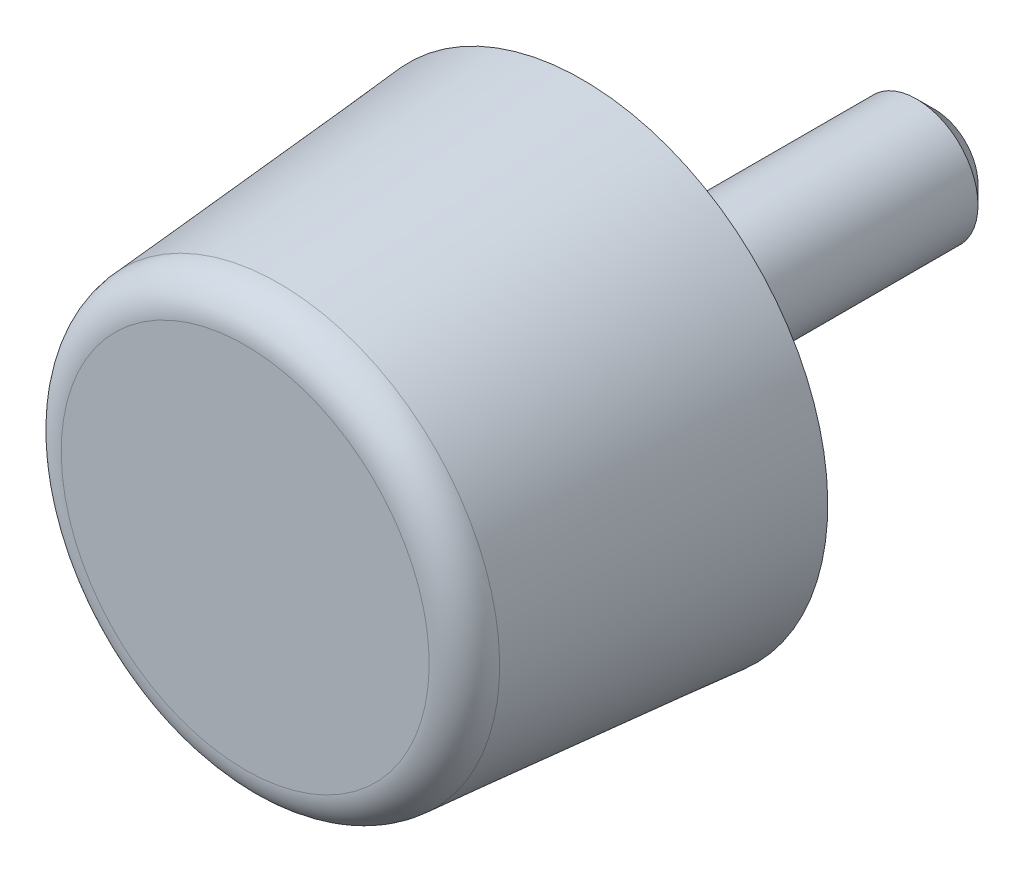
ISO-10303-21;
HEADER;
FILE_DESCRIPTION(('STEP AP214'),'2;1');
FILE_NAME('part.step','',(''),(''),'','','');
FILE_SCHEMA(('AUTOMOTIVE_DESIGN { 1 0 10303 214 1 1 1 1 }'));
ENDSEC;
DATA;
#1=APPLICATION_CONTEXT('core data for automotive mechanical design processes');
#2=APPLICATION_PROTOCOL_DEFINITION('international standard','automotive_design',2000,#1);
#3=PRODUCT_CONTEXT('',#1,'mechanical');
#4=PRODUCT('Part','Part','',(#3));
#5=PRODUCT_RELATED_PRODUCT_CATEGORY('part','',(#4));
#6=PRODUCT_DEFINITION_FORMATION('','',#4);
#7=PRODUCT_DEFINITION_CONTEXT('part definition',#1,'design');
#8=PRODUCT_DEFINITION('design','',#6,#7);
#9=PRODUCT_DEFINITION_SHAPE('','',#8);
#10=(LENGTH_UNIT() NAMED_UNIT(*) SI_UNIT(.MILLI.,.METRE.));
#11=(NAMED_UNIT(*) PLANE_ANGLE_UNIT() SI_UNIT($,.RADIAN.));
#12=(NAMED_UNIT(*) SI_UNIT($,.STERADIAN.) SOLID_ANGLE_UNIT());
#13=UNCERTAINTY_MEASURE_WITH_UNIT(LENGTH_MEASURE(1.E-05),#10,'distance_accuracy_value','');
#14=(GEOMETRIC_REPRESENTATION_CONTEXT(3) GLOBAL_UNCERTAINTY_ASSIGNED_CONTEXT((#13)) GLOBAL_UNIT_ASSIGNED_CONTEXT((#10,
#11,#12)) REPRESENTATION_CONTEXT('',''));
#15=CARTESIAN_POINT('',(0.,0.,0.));
#16=DIRECTION('',(0.,0.,1.));
#17=DIRECTION('',(1.,0.,0.));
#18=AXIS2_PLACEMENT_3D('',#15,#16,#17);
#19=CARTESIAN_POINT('',(0.,0.,22.));
#20=DIRECTION('',(0.,0.,1.));
#21=DIRECTION('',(0.,-1.,0.));
#22=AXIS2_PLACEMENT_3D('',#19,#20,#21);
#23=CYLINDRICAL_SURFACE('',#22,14.4);
#24=CARTESIAN_POINT('',(0.,0.,0.));
#25=DIRECTION('',(0.,0.,1.));
#26=DIRECTION('',(0.,-1.,0.));
#27=AXIS2_PLACEMENT_3D('',#24,#25,#26);
#28=CIRCLE('',#27,14.4);
#29=CARTESIAN_POINT('',(0.,-14.4,0.));
#30=VERTEX_POINT('',#29);
#31=EDGE_CURVE('E27',#30,#30,#28,.T.);
#32=ORIENTED_EDGE('',*,*,#31,.F.);
#33=EDGE_LOOP('',(#32));
#34=FACE_BOUND('',#33,.T.);
#35=CARTESIAN_POINT('',(0.,0.,0.049999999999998));
#36=DIRECTION('',(0.,0.,1.));
#37=DIRECTION('',(0.,-1.,0.));
#38=AXIS2_PLACEMENT_3D('',#35,#36,#37);
#39=CIRCLE('',#38,14.4);
#40=CARTESIAN_POINT('',(0.,-14.4,0.049999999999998));
#41=VERTEX_POINT('',#40);
#42=EDGE_CURVE('E44',#41,#41,#39,.T.);
#43=ORIENTED_EDGE('',*,*,#42,.T.);
#44=EDGE_LOOP('',(#43));
#45=FACE_BOUND('',#44,.T.);
#46=ADVANCED_FACE('F12',(#34,#45),#23,.F.);
#47=CARTESIAN_POINT('',(14.4,0.,0.));
#48=DIRECTION('',(0.,0.,1.));
#49=DIRECTION('',(0.,-1.,0.));
#50=AXIS2_PLACEMENT_3D('',#47,#48,#49);
#51=PLANE('',#50);
#52=CARTESIAN_POINT('',(0.,0.,0.));
#53=DIRECTION('',(0.,0.,1.));
#54=DIRECTION('',(0.,-1.,0.));
#55=AXIS2_PLACEMENT_3D('',#52,#53,#54);
#56=CIRCLE('',#55,16.);
#57=CARTESIAN_POINT('',(0.,-16.,0.));
#58=VERTEX_POINT('',#57);
#59=EDGE_CURVE('E32',#58,#58,#56,.T.);
#60=ORIENTED_EDGE('',*,*,#59,.F.);
#61=EDGE_LOOP('',(#60));
#62=FACE_BOUND('',#61,.T.);
#63=ORIENTED_EDGE('',*,*,#31,.T.);
#64=EDGE_LOOP('',(#63));
#65=FACE_BOUND('',#64,.T.);
#66=ADVANCED_FACE('F72',(#62,#65),#51,.F.);
#67=CARTESIAN_POINT('',(0.,0.,0.));
#68=DIRECTION('',(0.,0.,-1.));
#69=DIRECTION('',(0.,1.,0.));
#70=AXIS2_PLACEMENT_3D('',#67,#68,#69);
#71=CONICAL_SURFACE('',#70,16.,0.0810513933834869);
#72=CARTESIAN_POINT('',(0.,0.,19.7943104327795));
#73=DIRECTION('',(0.,0.,1.));
#74=DIRECTION('',(0.,-1.,0.));
#75=AXIS2_PLACEMENT_3D('',#72,#73,#74);
#76=CIRCLE('',#75,14.3921211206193);
#77=CARTESIAN_POINT('',(0.,-14.3921211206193,19.7943104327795));
#78=VERTEX_POINT('',#77);
#79=EDGE_CURVE('E35',#78,#78,#76,.T.);
#80=ORIENTED_EDGE('',*,*,#79,.F.);
#81=EDGE_LOOP('',(#80));
#82=FACE_BOUND('',#81,.T.);
#83=ORIENTED_EDGE('',*,*,#59,.T.);
#84=EDGE_LOOP('',(#83));
#85=FACE_BOUND('',#84,.T.);
#86=ADVANCED_FACE('F77',(#82,#85),#71,.T.);
#87=CARTESIAN_POINT('',(0.,0.,19.6));
#88=DIRECTION('',(0.,0.,1.));
#89=DIRECTION('',(0.,-1.,0.));
#90=AXIS2_PLACEMENT_3D('',#87,#88,#89);
#91=TOROIDAL_SURFACE('',#90,12.,2.4);
#92=ORIENTED_EDGE('',*,*,#79,.T.);
#93=EDGE_LOOP('',(#92));
#94=FACE_BOUND('',#93,.T.);
#95=CARTESIAN_POINT('',(0.,0.,22.));
#96=DIRECTION('',(0.,0.,1.));
#97=DIRECTION('',(0.,-1.,0.));
#98=AXIS2_PLACEMENT_3D('',#95,#96,#97);
#99=CIRCLE('',#98,12.);
#100=CARTESIAN_POINT('',(0.,-12.,22.));
#101=VERTEX_POINT('',#100);
#102=EDGE_CURVE('E38',#101,#101,#99,.T.);
#103=ORIENTED_EDGE('',*,*,#102,.F.);
#104=EDGE_LOOP('',(#103));
#105=FACE_BOUND('',#104,.T.);
#106=ADVANCED_FACE('F84',(#94,#105),#91,.T.);
#107=CARTESIAN_POINT('',(12.,0.,22.));
#108=DIRECTION('',(0.,0.,-1.));
#109=DIRECTION('',(0.,1.,0.));
#110=AXIS2_PLACEMENT_3D('',#107,#108,#109);
#111=PLANE('',#110);
#112=ORIENTED_EDGE('',*,*,#102,.T.);
#113=EDGE_LOOP('',(#112));
#114=FACE_BOUND('',#113,.T.);
#115=ADVANCED_FACE('F59',(#114),#111,.F.);
#116=CARTESIAN_POINT('',(0.,0.,0.));
#117=DIRECTION('',(0.,0.,1.));
#118=DIRECTION('',(0.,-1.,0.));
#119=AXIS2_PLACEMENT_3D('',#116,#117,#118);
#120=PLANE('',#119);
#121=CARTESIAN_POINT('',(0.,0.,0.));
#122=DIRECTION('',(0.,0.,1.));
#123=DIRECTION('',(0.,-1.,0.));
#124=AXIS2_PLACEMENT_3D('',#121,#122,#123);
#125=CIRCLE('',#124,14.35);
#126=CARTESIAN_POINT('',(0.,-14.35,0.));
#127=VERTEX_POINT('',#126);
#128=EDGE_CURVE('E41',#127,#127,#125,.T.);
#129=ORIENTED_EDGE('',*,*,#128,.F.);
#130=EDGE_LOOP('',(#129));
#131=FACE_BOUND('',#130,.T.);
#132=CARTESIAN_POINT('',(0.,0.,0.));
#133=DIRECTION('',(0.,0.,1.));
#134=DIRECTION('',(0.,-1.,0.));
#135=AXIS2_PLACEMENT_3D('',#132,#133,#134);
#136=CIRCLE('',#135,4.);
#137=CARTESIAN_POINT('',(0.,-4.,0.));
#138=VERTEX_POINT('',#137);
#139=EDGE_CURVE('E23',#138,#138,#136,.T.);
#140=ORIENTED_EDGE('',*,*,#139,.T.);
#141=EDGE_LOOP('',(#140));
#142=FACE_BOUND('',#141,.T.);
#143=ADVANCED_FACE('F53',(#131,#142),#120,.F.);
#144=CARTESIAN_POINT('',(0.,0.,0.));
#145=DIRECTION('',(0.,0.,1.));
#146=DIRECTION('',(0.,-1.,0.));
#147=AXIS2_PLACEMENT_3D('',#144,#145,#146);
#148=CONICAL_SURFACE('',#147,14.35,0.785398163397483);
#149=ORIENTED_EDGE('',*,*,#42,.F.);
#150=EDGE_LOOP('',(#149));
#151=FACE_BOUND('',#150,.T.);
#152=ORIENTED_EDGE('',*,*,#128,.T.);
#153=EDGE_LOOP('',(#152));
#154=FACE_BOUND('',#153,.T.);
#155=ADVANCED_FACE('F49',(#151,#154),#148,.T.);
#156=CARTESIAN_POINT('',(0.,0.,22.));
#157=DIRECTION('',(0.,0.,1.));
#158=DIRECTION('',(0.,-1.,0.));
#159=AXIS2_PLACEMENT_3D('',#156,#157,#158);
#160=CYLINDRICAL_SURFACE('',#159,4.);
#161=CARTESIAN_POINT('',(0.,0.,-21.8));
#162=DIRECTION('',(0.,0.,-1.));
#163=DIRECTION('',(0.,1.,0.));
#164=AXIS2_PLACEMENT_3D('',#161,#162,#163);
#165=CIRCLE('',#164,4.);
#166=CARTESIAN_POINT('',(0.,4.,-21.8));
#167=VERTEX_POINT('',#166);
#168=EDGE_CURVE('E8',#167,#167,#165,.F.);
#169=ORIENTED_EDGE('',*,*,#168,.T.);
#170=EDGE_LOOP('',(#169));
#171=FACE_BOUND('',#170,.T.);
#172=ORIENTED_EDGE('',*,*,#139,.F.);
#173=EDGE_LOOP('',(#172));
#174=FACE_BOUND('',#173,.T.);
#175=ADVANCED_FACE('F52',(#171,#174),#160,.T.);
#176=CARTESIAN_POINT('',(0.,0.,-23.));
#177=DIRECTION('',(0.,0.,-1.));
#178=DIRECTION('',(0.,1.,0.));
#179=AXIS2_PLACEMENT_3D('',#176,#177,#178);
#180=PLANE('',#179);
#181=CARTESIAN_POINT('',(0.,0.,-23.));
#182=DIRECTION('',(0.,0.,-1.));
#183=DIRECTION('',(0.,1.,0.));
#184=AXIS2_PLACEMENT_3D('',#181,#182,#183);
#185=CIRCLE('',#184,2.8);
#186=CARTESIAN_POINT('',(0.,2.8,-23.));
#187=VERTEX_POINT('',#186);
#188=EDGE_CURVE('E19',#187,#187,#185,.T.);
#189=ORIENTED_EDGE('',*,*,#188,.T.);
#190=EDGE_LOOP('',(#189));
#191=FACE_BOUND('',#190,.T.);
#192=ADVANCED_FACE('F64',(#191),#180,.T.);
#193=CARTESIAN_POINT('',(0.,0.,-23.));
#194=DIRECTION('',(0.,0.,1.));
#195=DIRECTION('',(0.,-1.,0.));
#196=AXIS2_PLACEMENT_3D('',#193,#194,#195);
#197=CONICAL_SURFACE('',#196,2.8,0.785398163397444);
#198=ORIENTED_EDGE('',*,*,#168,.F.);
#199=EDGE_LOOP('',(#198));
#200=FACE_BOUND('',#199,.T.);
#201=ORIENTED_EDGE('',*,*,#188,.F.);
#202=EDGE_LOOP('',(#201));
#203=FACE_BOUND('',#202,.T.);
#204=ADVANCED_FACE('F14',(#200,#203),#197,.T.);
#205=CLOSED_SHELL('',(#46,#66,#86,#106,#115,#143,#155,#175,#192,#204));
#206=MANIFOLD_SOLID_BREP('B1',#205);
#207=ADVANCED_BREP_SHAPE_REPRESENTATION('',(#18,#206),#14);
#208=SHAPE_DEFINITION_REPRESENTATION(#9,#207);
ENDSEC;
END-ISO-10303-21;
